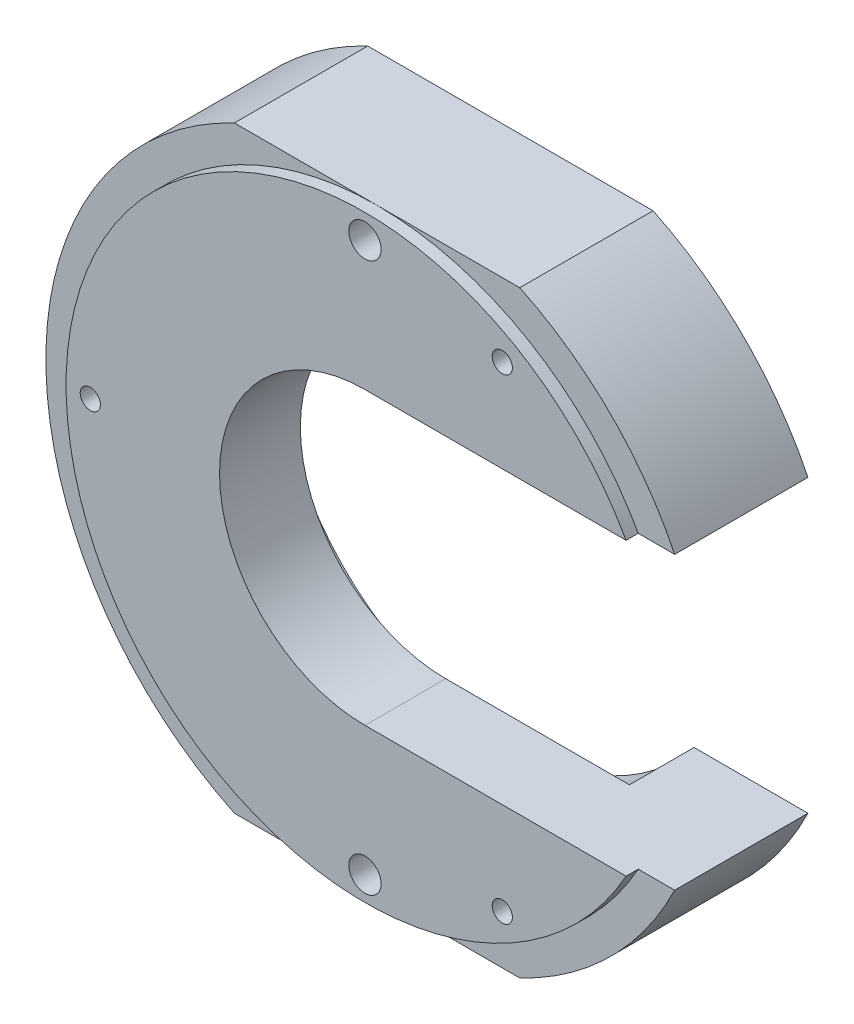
from build123d import *

# Parameters (mm, degrees)
EXTRUDE_1_DEPTH              = 16.5
CUT_EXTRUDE_1_DEPTH          = 8
EXTRUDE_3_DEPTH              = 1.5
SKETCH_5_R                   = 2.95
CUT_EXTRUDE_6_DEPTH          = 4
HOLE_WIZARD_M3_1_D           = 2.5
HOLE_WIZARD_M3_1_CSINK_D     = 3.05
HOLE_WIZARD_M3_1_CSINK_ANGLE = 90
F_4_0MM_1_D                  = 4
F_4_0MM_1_CSINK_D            = 4.05
F_4_0MM_1_CSINK_ANGLE        = 90


with BuildPart() as part:
    # Sketch 1 → Extrude 1 (new body)
    with BuildSketch(Plane.XY):
        with BuildLine():
            Line((-17.663521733, 37), (17.663521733, 37))
            ThreePointArc((17.663521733, 37), (28.858964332, 29.123189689), (36.837480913, 18))
            Line((36.837480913, 18), (0, 18))
            ThreePointArc((0, 18), (-18, 0), (0, -18))
            Line((0, -18), (36.837480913, -18))
            ThreePointArc((36.837480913, -18), (28.858964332, -29.123189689), (17.663521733, -37))
            Line((17.663521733, -37), (-17.663521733, -37))
            ThreePointArc((-17.663521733, -37), (-41, 0), (-17.663521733, 37))
        make_face()
    extrude(amount=EXTRUDE_1_DEPTH)

    # Sketch 3 → Cut-Extrude 1 (cut)
    with BuildSketch(Plane(origin=(0, 0, 0), x_dir=(-1, 0, 0), z_dir=(0, 0, -1))):
        with BuildLine():
            Line((-22.737634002, 18), (0, 18))
            ThreePointArc((0, 18), (18, 0), (0, -18))
            Line((0, -18), (-22.737634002, -18))
            ThreePointArc((-22.737634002, -18), (29, 0), (-22.737634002, 18))
        make_face()
    extrude(amount=-CUT_EXTRUDE_1_DEPTH, mode=Mode.SUBTRACT)

    # Sketch 2 → Extrude 3 (add)
    with BuildSketch(Plane.XY.offset(16.5)):
        with BuildLine():
            Line((32.32645975, 18), (0, 18))
            ThreePointArc((0, 18), (-18, 0), (0, -18))
            Line((0, -18), (32.32645975, -18))
            ThreePointArc((32.32645975, -18), (18.748333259, -31.898275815), (0, -37))
            ThreePointArc((0, -37), (-37, 0), (0, 37))
            ThreePointArc((0, 37), (18.748333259, 31.898275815), (32.32645975, 18))
        make_face()
    extrude(amount=EXTRUDE_3_DEPTH)

    # Sketch 5 → Cut-Extrude 6 (cut)
    with BuildSketch(Plane(origin=(0, 0, 0), x_dir=(-1, 0, 0), z_dir=(0, 0, -1))):
        with Locations((0, 34)):
            Circle(SKETCH_5_R)
        with Locations((0, -34)):
            Circle(SKETCH_5_R)
    extrude(amount=-CUT_EXTRUDE_6_DEPTH, mode=Mode.SUBTRACT)

    # Hole Wizard M3 _1 (through all)
    with Locations(Plane(origin=(0, 0, 0), x_dir=(-1, 0, 0), z_dir=(0, 0, -1))):
        with Locations((-17, 29.444863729), (-17, -29.444863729), (34, 0)):
            CounterSinkHole(HOLE_WIZARD_M3_1_D / 2, HOLE_WIZARD_M3_1_CSINK_D / 2, counter_sink_angle=HOLE_WIZARD_M3_1_CSINK_ANGLE)

    # 4.0mm _1 (through all)
    with Locations(Plane(origin=(0, 0, 4), x_dir=(-1, 0, 0), z_dir=(0, 0, -1))):
        with Locations((0, 34), (0, -34)):
            CounterSinkHole(F_4_0MM_1_D / 2, F_4_0MM_1_CSINK_D / 2, counter_sink_angle=F_4_0MM_1_CSINK_ANGLE)


solid = part.part
